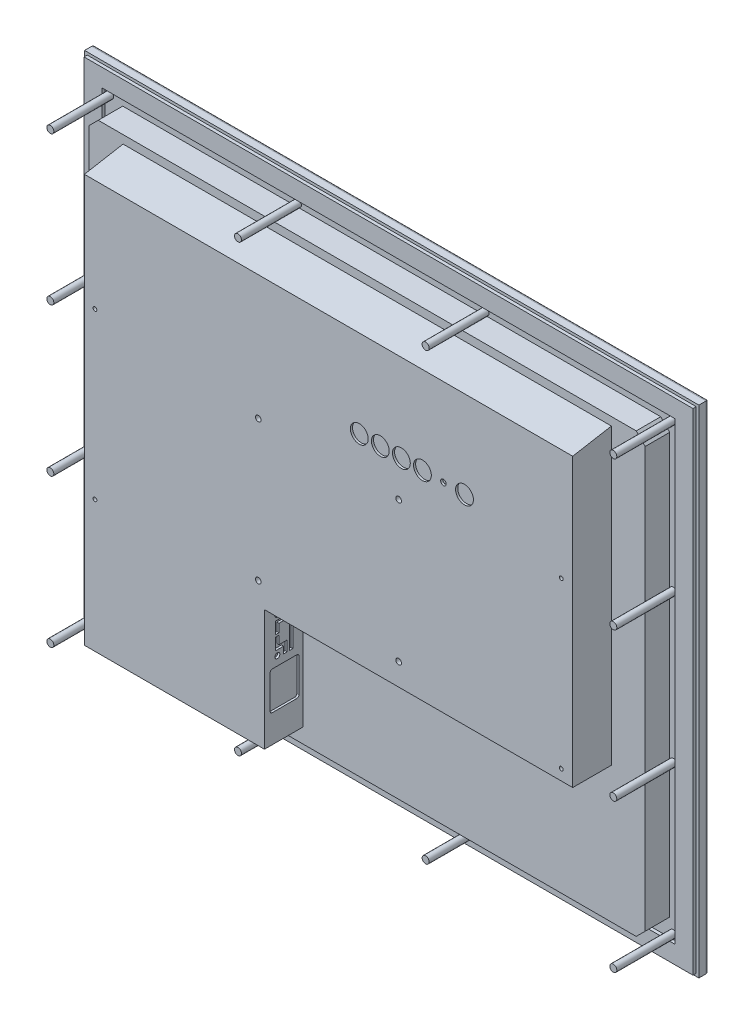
from build123d import *

# Parameters (mm, degrees)
SKETCH1_W                                 = 437.769
SKETCH1_H                                 = 353.568
BEZEL_DEPTH                               = 7.112
BEZEL_RADIUS_R                            = 2
SKETCH2_W                                 = 340.36
SKETCH2_H                                 = 272.796
WINDOW_DEPTH                              = 2.35
SKETCH3_W                                 = 433.959
SKETCH3_H                                 = 349.758
SKETCH3_W_2                               = 408.559
SKETCH3_H_2                               = 324.358
GASKET_DEPTH                              = 2.3
SKETCH5_R                                 = 2.5
PANEL_FRAME_STUDS_DEPTH                   = 42.7
BODY_DEPTH                                = 17.4498
REAR_COVER_DEPTH                          = 27.559
REAR_COVER_SLOPE_ANGLE                    = 10
F_4_0MM_VESA_HOLES_AT_2_COUNT             = 2
F_4_0MM_VESA_HOLES_AT_2_PITCH             = 100
F_4_0MM_VESA_HOLES_AT_3_COUNT             = 2
F_4_0MM_VESA_HOLES_AT_3_PITCH             = 141.421356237
F_4_0MM_VESA_HOLES_AT_4_COUNT             = 2
F_4_0MM_VESA_HOLES_AT_4_PITCH             = 100
SKETCH10_R                                = 1.5875
VIDEO_TOUCH_INTERFACE_DEPTH               = 1.524
SKETCH11_R                                = 1.7907
SKETCH11_W                                = 2.54
SKETCH11_H                                = 27.94
POWER_AC_AND_DC_DEPTH                     = 1.524
SKETCH12_R                                = 6.35
SKETCH12_R_2                              = 1.9812
CONTROLS_BUTTONS_DEPTH                    = 1.524
F_6_32_ACCESSORY_BRACKET_HOLES_AT_2_COUNT = 2
F_6_32_ACCESSORY_BRACKET_HOLES_AT_2_PITCH = 117.5258
F_6_32_ACCESSORY_BRACKET_HOLES_AT_3_COUNT = 2
F_6_32_ACCESSORY_BRACKET_HOLES_AT_3_PITCH = 352.502390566
F_6_32_ACCESSORY_BRACKET_HOLES_AT_4_COUNT = 2
F_6_32_ACCESSORY_BRACKET_HOLES_AT_4_PITCH = 332.3336


with BuildPart() as part:
    # Sketch1 → Bezel (new body)
    with BuildSketch(Plane.XY):
        Rectangle(SKETCH1_W, SKETCH1_H)
    extrude(amount=-BEZEL_DEPTH)

    # Bezel Radius
    bezel_radius_edges = [part.edges().sort_by_distance(p)[0] for p in [
        (218.8845, 0, -7.112),
        (0, 176.784, -7.112),
        (-218.8845, 0, -7.112),
        (0, -176.784, -7.112),
    ]]
    fillet(bezel_radius_edges, radius=BEZEL_RADIUS_R)

    # Sketch2 → Window (cut)
    with BuildSketch(Plane(origin=(0, 0, -7.112), x_dir=(-1, 0, 0), z_dir=(0, 0, -1))):
        Rectangle(SKETCH2_W, SKETCH2_H)
    extrude(amount=-WINDOW_DEPTH, mode=Mode.SUBTRACT)

    # Sketch3 → Gasket (add)
    with BuildSketch(Plane.XY):
        Rectangle(SKETCH3_W, SKETCH3_H)
        Rectangle(SKETCH3_W_2, SKETCH3_H_2, mode=Mode.SUBTRACT)
    extrude(amount=GASKET_DEPTH)

    # Sketch5 → Panel Frame Studs (add)
    with BuildSketch(Plane.XY):
        with Locations(Location((-200.5965, 158.496, 0), (0, 0, 180))):
            Circle(SKETCH5_R)
        with Locations(Location((-200.5965, -158.496, 0), (0, 0, 180))):
            Circle(SKETCH5_R)
        with Locations(Location((-66.8655, 158.496, 0), (0, 0, 180))):
            Circle(SKETCH5_R)
        with Locations(Location((-66.8655, -158.496, 0), (0, 0, 180))):
            Circle(SKETCH5_R)
        with Locations(Location((66.8655, 158.496, 0), (0, 0, 180))):
            Circle(SKETCH5_R)
        with Locations(Location((66.8655, -158.496, 0), (0, 0, 180))):
            Circle(SKETCH5_R)
        with Locations(Location((200.5965, 158.496, 0), (0, 0, 180))):
            Circle(SKETCH5_R)
        with Locations(Location((200.5965, -158.496, 0), (0, 0, 180))):
            Circle(SKETCH5_R)
        with Locations(Location((-200.5965, 52.832, 0), (0, 0, 180))):
            Circle(SKETCH5_R)
        with Locations(Location((200.5965, 52.832, 0), (0, 0, 180))):
            Circle(SKETCH5_R)
        with Locations(Location((-200.5965, -52.832, 0), (0, 0, 180))):
            Circle(SKETCH5_R)
        with Locations(Location((200.5965, -52.832, 0), (0, 0, 180))):
            Circle(SKETCH5_R)
    extrude(amount=PANEL_FRAME_STUDS_DEPTH)


with BuildPart() as body_2:
    # Sketch6 → Body (new body)
    with BuildSketch(Plane.XY):
        Polygon((-198.0965, 149.58409713), (-191.68459713, 155.996), (191.68459713, 155.996), (198.0965, 149.58409713), (198.0965, -149.58409713), (191.68459713, -155.996), (-191.68459713, -155.996), (-198.0965, -149.58409713), align=None)
    extrude(amount=BODY_DEPTH)


with BuildPart() as body_3:
    # Sketch7 → Rear Cover (new body)
    with BuildSketch(Plane.XY.offset(17.4498)):
        Polygon((-173.99, 150.1394), (173.99, 150.1394), (173.99, -59.2074), (-45.6692, -59.2074), (-45.6692, -145.3896), (-173.99, -145.3896), align=None)
    extrude(amount=REAR_COVER_DEPTH)

    # Rear Cover Slope
    rear_cover_slope_faces = [body_3.faces().sort_by_distance(p)[0] for p in [
        (0, 150.1394, 31.2293),
    ]]
    draft(rear_cover_slope_faces, Plane.XY.offset(17.4498), REAR_COVER_SLOPE_ANGLE)

    # Sketch9 → 4.0mm VESA Holes (revolve, cut)
    with BuildSketch(Plane(origin=(-50.0253, 56.5152, 45.0088), x_dir=(0, -1, 0), z_dir=(1, 0, 0))):
        Polygon((0, 0), (0, 17.203721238), (2, 16.002), (2, 0), align=None)
    f_4_0mm_vesa_holes = revolve(axis=Axis((-50.0253, 56.5152, 51.3588), (0, 0, -1)), mode=Mode.SUBTRACT)

    # 4.0mm VESA Holes at 2: 4.0mm VESA Holes ×2
    with Locations(*[(i * F_4_0MM_VESA_HOLES_AT_2_PITCH, 0, 0) for i in range(1, F_4_0MM_VESA_HOLES_AT_2_COUNT)]):
        add(f_4_0mm_vesa_holes, mode=Mode.SUBTRACT)

    # 4.0mm VESA Holes at 3: 4.0mm VESA Holes ×2
    with Locations(*[Vector(0.7071067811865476, -0.7071067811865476, 0) * (i * F_4_0MM_VESA_HOLES_AT_3_PITCH) for i in range(1, F_4_0MM_VESA_HOLES_AT_3_COUNT)]):
        add(f_4_0mm_vesa_holes, mode=Mode.SUBTRACT)

    # 4.0mm VESA Holes at 4: 4.0mm VESA Holes ×2
    with Locations(*[(0, -i * F_4_0MM_VESA_HOLES_AT_4_PITCH, 0) for i in range(1, F_4_0MM_VESA_HOLES_AT_4_COUNT)]):
        add(f_4_0mm_vesa_holes, mode=Mode.SUBTRACT)

    # Sketch10 → Video _ Touch Interface (cut)
    with BuildSketch(Plane(origin=(0, -59.2074, 0), x_dir=(1, 0, 0), z_dir=(0, 1, 0))):
        with Locations((54.068305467, -28.20091993)):
            Circle(SKETCH10_R)
        with Locations((21.556305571, -28.20091993)):
            Circle(SKETCH10_R)
        with Locations((87.982705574, -29.72491993)):
            Circle(SKETCH10_R)
        with Locations((62.982711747, -29.72491993)):
            Circle(SKETCH10_R)
        with Locations((107.652134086, -29.34391993)):
            Circle(SKETCH10_R)
        with Locations((132.652127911, -29.34391993)):
            Circle(SKETCH10_R)
        with BuildLine():
            Line((51.47430861, -30.74091993), (51.47430861, -25.66091993))
            ThreePointArc((51.47430861, -25.66091993), (50.58883367, -23.461215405), (48.426308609, -22.488460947))
            Line((48.426308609, -22.488460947), (27.198302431, -22.488460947))
            ThreePointArc((27.198302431, -22.488460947), (25.03577737, -23.461215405), (24.15030243, -25.66091993))
            Line((24.15030243, -25.66091993), (24.15030243, -30.74091993))
            ThreePointArc((24.15030243, -30.74091993), (25.03577737, -32.940624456), (27.198302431, -33.913378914))
            Line((27.198302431, -33.913378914), (48.426308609, -33.913378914))
            ThreePointArc((48.426308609, -33.913378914), (50.58883367, -32.940624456), (51.47430861, -30.74091993))
        make_face()
        with BuildLine():
            Line((85.642669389, -27.17221993), (85.642669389, -32.25221993))
            ThreePointArc((85.642669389, -32.25221993), (84.757194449, -34.451924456), (82.59466939, -35.424678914))
            Line((82.59466939, -35.424678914), (68.370669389, -35.424678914))
            ThreePointArc((68.370669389, -35.424678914), (66.208144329, -34.451924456), (65.322669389, -32.25221993))
            Line((65.322669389, -32.25221993), (65.322669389, -27.17221993))
            ThreePointArc((65.322669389, -27.17221993), (66.20814433, -24.972515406), (68.370669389, -23.999760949))
            Line((68.370669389, -23.999760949), (82.467097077, -23.997219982))
            ThreePointArc((82.467097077, -23.997219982), (84.712531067, -24.926953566), (85.642669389, -27.17221993))
        make_face()
        with BuildLine():
            Line((109.992091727, -26.816619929), (109.992091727, -31.89661993))
            ThreePointArc((109.992091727, -31.89661993), (110.877566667, -34.096324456), (113.040091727, -35.069078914))
            Line((113.040091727, -35.069078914), (127.136519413, -35.07161988))
            ThreePointArc((127.136519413, -35.07161988), (129.381953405, -34.141886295), (130.312091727, -31.89661993))
            Line((130.312091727, -31.89661993), (130.312091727, -26.81661993))
            ThreePointArc((130.312091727, -26.81661993), (129.426616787, -24.616915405), (127.264091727, -23.644160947))
            Line((127.264091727, -23.644160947), (113.040091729, -23.644160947))
            ThreePointArc((113.040091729, -23.644160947), (110.877566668, -24.616915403), (109.992091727, -26.816619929))
        make_face()
        with BuildLine():
            Line((161.930703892, -23.24791993), (145.928703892, -23.24791993))
            Line((145.928703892, -23.24791993), (145.928703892, -27.75641993))
            Line((145.928703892, -27.75641993), (141.483703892, -27.75641993))
            ThreePointArc((141.483703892, -27.75641993), (139.896203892, -29.34391993), (141.483703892, -30.93141993))
            Line((141.483703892, -30.93141993), (145.928703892, -30.93141993))
            Line((145.928703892, -30.93141993), (145.928703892, -35.43991993))
            Line((145.928703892, -35.43991993), (161.930703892, -35.43991993))
            Line((161.930703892, -35.43991993), (161.930703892, -30.93141993))
            Line((161.930703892, -30.93141993), (166.375703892, -30.93141993))
            ThreePointArc((166.375703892, -30.93141993), (167.963203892, -29.34391993), (166.375703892, -27.75641993))
            Line((166.375703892, -27.75641993), (161.930703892, -27.75641993))
            Line((161.930703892, -27.75641993), (161.930703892, -23.24791993))
        make_face()
    extrude(amount=VIDEO_TOUCH_INTERFACE_DEPTH, mode=Mode.SUBTRACT)

    # Sketch11 → Power AC and DC (cut)
    with BuildSketch(Plane.ZY.offset(45.6692)):
        with Locations(Location((35.814, -92.206196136, 0), (0, 0, 180))):
            Circle(SKETCH11_R)
        with Locations(Location((35.814, -66.628396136, 0), (0, 0, 180))):
            Circle(SKETCH11_R)
        Polygon((31.3182, -93.387296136), (31.3182, -88.573996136), (37.211, -88.573996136), (37.211, -80.179296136), (34.671, -80.179296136), (34.671, -86.033996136), (28.7782, -86.033996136), (28.7782, -93.387296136), align=None)
        with Locations((25.9842, -79.417296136)):
            Rectangle(SKETCH11_W, SKETCH11_H)
        Polygon((28.7782, -65.447296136), (31.3182, -65.447296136), (31.3182, -70.260596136), (37.211, -70.260596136), (37.211, -78.655296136), (34.671, -78.655296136), (34.671, -72.800596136), (28.7782, -72.800596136), align=None)
        with BuildLine():
            Line((20.459943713, -100.11945365), (20.459943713, -124.05895204))
            ThreePointArc((20.459943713, -124.05895204), (20.905759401, -125.136028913), (21.982377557, -125.582951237))
            Line((21.982377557, -125.582951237), (39.433752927, -125.582951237))
            ThreePointArc((39.433752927, -125.582951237), (40.511383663, -125.13658197), (40.957752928, -124.058951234))
            Line((40.957752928, -124.058951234), (40.957752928, -100.119452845))
            ThreePointArc((40.957752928, -100.119452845), (40.51193724, -99.042375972), (39.435319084, -98.59545365))
            Line((39.435319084, -98.59545365), (21.983943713, -98.59545365))
            ThreePointArc((21.983943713, -98.59545365), (20.906312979, -99.041822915), (20.459943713, -100.11945365))
        make_face()
    extrude(amount=POWER_AC_AND_DC_DEPTH, mode=Mode.SUBTRACT)

    # Sketch12 → Controls Buttons (cut)
    with BuildSketch(Plane.XY.offset(45.0088)):
        with Locations((21.888258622, 83.042682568)):
            Circle(SKETCH12_R)
        with Locations((36.888258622, 83.042682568)):
            Circle(SKETCH12_R)
        with Locations((51.888258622, 83.042682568)):
            Circle(SKETCH12_R)
        with Locations((66.888258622, 83.042682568)):
            Circle(SKETCH12_R)
        with Locations((81.888258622, 83.042682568)):
            Circle(SKETCH12_R_2)
        with Locations((96.888258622, 83.042682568)):
            Circle(SKETCH12_R)
    extrude(amount=-CONTROLS_BUTTONS_DEPTH, mode=Mode.SUBTRACT)

    # Sketch14 → 6-32 Accessory Bracket Holes (revolve, cut)
    with BuildSketch(Plane(origin=(-166.4589, -51.5874, 45.0088), x_dir=(0, -1, 0), z_dir=(1, 0, 0))):
        Polygon((0, 0), (0, 16.81469403), (1.35255, 16.002), (1.35255, 0), align=None)
    f_6_32_accessory_bracket_holes = revolve(axis=Axis((-166.4589, -51.5874, 51.3588), (0, 0, -1)), mode=Mode.SUBTRACT)

    # 6-32 Accessory Bracket Holes at 2: 6-32 Accessory Bracket Holes ×2
    with Locations(*[(0, i * F_6_32_ACCESSORY_BRACKET_HOLES_AT_2_PITCH, 0) for i in range(1, F_6_32_ACCESSORY_BRACKET_HOLES_AT_2_COUNT)]):
        add(f_6_32_accessory_bracket_holes, mode=Mode.SUBTRACT)

    # 6-32 Accessory Bracket Holes at 3: 6-32 Accessory Bracket Holes ×2
    with Locations(*[Vector(0.9427839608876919, 0.3334042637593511, 0) * (i * F_6_32_ACCESSORY_BRACKET_HOLES_AT_3_PITCH) for i in range(1, F_6_32_ACCESSORY_BRACKET_HOLES_AT_3_COUNT)]):
        add(f_6_32_accessory_bracket_holes, mode=Mode.SUBTRACT)

    # 6-32 Accessory Bracket Holes at 4: 6-32 Accessory Bracket Holes ×2
    with Locations(*[(i * F_6_32_ACCESSORY_BRACKET_HOLES_AT_4_PITCH, 0, 0) for i in range(1, F_6_32_ACCESSORY_BRACKET_HOLES_AT_4_COUNT)]):
        add(f_6_32_accessory_bracket_holes, mode=Mode.SUBTRACT)


solid = Compound([part.part, body_2.part, body_3.part])
